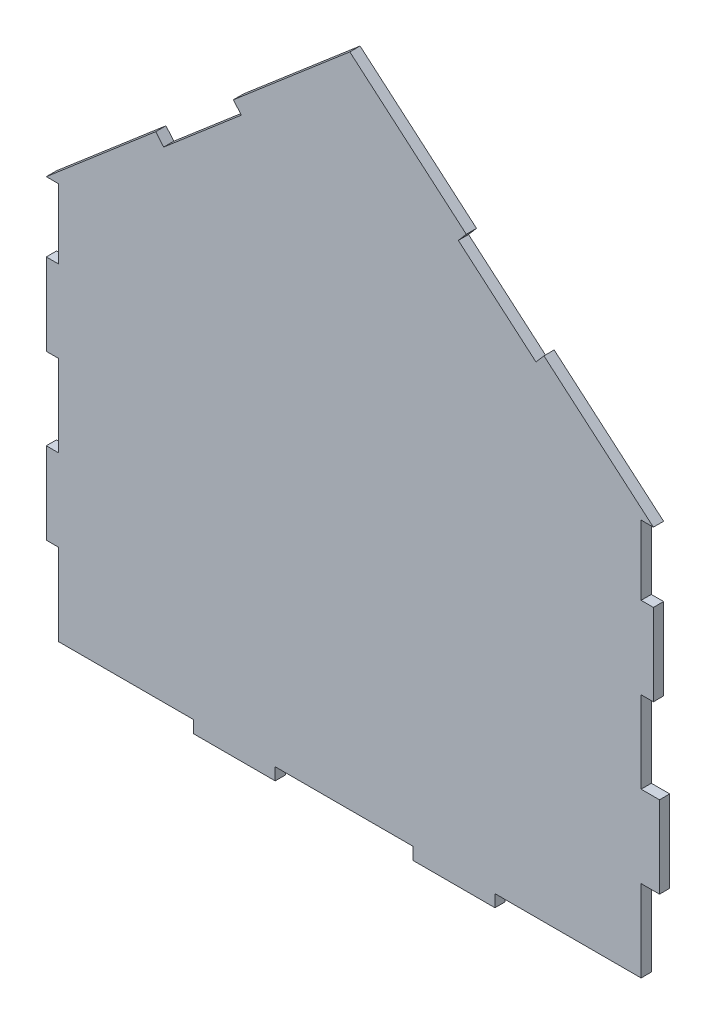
ISO-10303-21;
HEADER;
FILE_DESCRIPTION(('STEP AP214'),'2;1');
FILE_NAME('part.step','',(''),(''),'','','');
FILE_SCHEMA(('AUTOMOTIVE_DESIGN { 1 0 10303 214 1 1 1 1 }'));
ENDSEC;
DATA;
#1=APPLICATION_CONTEXT('core data for automotive mechanical design processes');
#2=APPLICATION_PROTOCOL_DEFINITION('international standard','automotive_design',2000,#1);
#3=PRODUCT_CONTEXT('',#1,'mechanical');
#4=PRODUCT('Part','Part','',(#3));
#5=PRODUCT_RELATED_PRODUCT_CATEGORY('part','',(#4));
#6=PRODUCT_DEFINITION_FORMATION('','',#4);
#7=PRODUCT_DEFINITION_CONTEXT('part definition',#1,'design');
#8=PRODUCT_DEFINITION('design','',#6,#7);
#9=PRODUCT_DEFINITION_SHAPE('','',#8);
#10=(LENGTH_UNIT() NAMED_UNIT(*) SI_UNIT(.MILLI.,.METRE.));
#11=(NAMED_UNIT(*) PLANE_ANGLE_UNIT() SI_UNIT($,.RADIAN.));
#12=(NAMED_UNIT(*) SI_UNIT($,.STERADIAN.) SOLID_ANGLE_UNIT());
#13=UNCERTAINTY_MEASURE_WITH_UNIT(LENGTH_MEASURE(1.E-05),#10,'distance_accuracy_value','');
#14=(GEOMETRIC_REPRESENTATION_CONTEXT(3) GLOBAL_UNCERTAINTY_ASSIGNED_CONTEXT((#13)) GLOBAL_UNIT_ASSIGNED_CONTEXT((#10,
#11,#12)) REPRESENTATION_CONTEXT('',''));
#15=CARTESIAN_POINT('',(0.,0.,0.));
#16=DIRECTION('',(0.,0.,1.));
#17=DIRECTION('',(1.,0.,0.));
#18=AXIS2_PLACEMENT_3D('',#15,#16,#17);
#19=CARTESIAN_POINT('',(-297.,-114.,10.));
#20=DIRECTION('',(0.,1.,0.));
#21=DIRECTION('',(0.,0.,1.));
#22=AXIS2_PLACEMENT_3D('',#19,#20,#21);
#23=PLANE('',#22);
#24=DIRECTION('',(1.,0.,0.));
#25=VECTOR('',#24,1.);
#26=CARTESIAN_POINT('',(-297.,-114.,0.));
#27=LINE('',#26,#25);
#28=CARTESIAN_POINT('',(-297.,-114.,0.));
#29=VERTEX_POINT('',#28);
#30=CARTESIAN_POINT('',(-285.,-114.,0.));
#31=VERTEX_POINT('',#30);
#32=EDGE_CURVE('E321',#29,#31,#27,.T.);
#33=ORIENTED_EDGE('',*,*,#32,.T.);
#34=DIRECTION('',(0.,0.,-1.));
#35=VECTOR('',#34,1.);
#36=CARTESIAN_POINT('',(-285.,-114.,10.));
#37=LINE('',#36,#35);
#38=CARTESIAN_POINT('',(-285.,-114.,10.));
#39=VERTEX_POINT('',#38);
#40=EDGE_CURVE('E11',#39,#31,#37,.T.);
#41=ORIENTED_EDGE('',*,*,#40,.F.);
#42=DIRECTION('',(1.,0.,0.));
#43=VECTOR('',#42,1.);
#44=CARTESIAN_POINT('',(-297.,-114.,10.));
#45=LINE('',#44,#43);
#46=CARTESIAN_POINT('',(-297.,-114.,10.));
#47=VERTEX_POINT('',#46);
#48=EDGE_CURVE('E400',#47,#39,#45,.T.);
#49=ORIENTED_EDGE('',*,*,#48,.F.);
#50=DIRECTION('',(0.,0.,-1.));
#51=VECTOR('',#50,1.);
#52=CARTESIAN_POINT('',(-297.,-114.,10.));
#53=LINE('',#52,#51);
#54=EDGE_CURVE('E320',#47,#29,#53,.T.);
#55=ORIENTED_EDGE('',*,*,#54,.T.);
#56=EDGE_LOOP('',(#33,#41,#49,#55));
#57=FACE_BOUND('',#56,.T.);
#58=ADVANCED_FACE('F39',(#57),#23,.F.);
#59=CARTESIAN_POINT('',(-285.,-114.,10.));
#60=DIRECTION('',(1.,0.,0.));
#61=DIRECTION('',(0.,0.,-1.));
#62=AXIS2_PLACEMENT_3D('',#59,#60,#61);
#63=PLANE('',#62);
#64=DIRECTION('',(0.,-1.,0.));
#65=VECTOR('',#64,1.);
#66=CARTESIAN_POINT('',(-285.,-114.,0.));
#67=LINE('',#66,#65);
#68=CARTESIAN_POINT('',(-285.,-194.,0.));
#69=VERTEX_POINT('',#68);
#70=EDGE_CURVE('E322',#31,#69,#67,.T.);
#71=ORIENTED_EDGE('',*,*,#70,.T.);
#72=DIRECTION('',(0.,0.,-1.));
#73=VECTOR('',#72,1.);
#74=CARTESIAN_POINT('',(-285.,-194.,10.));
#75=LINE('',#74,#73);
#76=CARTESIAN_POINT('',(-285.,-194.,10.));
#77=VERTEX_POINT('',#76);
#78=EDGE_CURVE('E50',#77,#69,#75,.T.);
#79=ORIENTED_EDGE('',*,*,#78,.F.);
#80=DIRECTION('',(0.,-1.,0.));
#81=VECTOR('',#80,1.);
#82=CARTESIAN_POINT('',(-285.,-114.,10.));
#83=LINE('',#82,#81);
#84=EDGE_CURVE('E193',#39,#77,#83,.T.);
#85=ORIENTED_EDGE('',*,*,#84,.F.);
#86=ORIENTED_EDGE('',*,*,#40,.T.);
#87=EDGE_LOOP('',(#71,#79,#85,#86));
#88=FACE_BOUND('',#87,.T.);
#89=ADVANCED_FACE('F608',(#88),#63,.F.);
#90=CARTESIAN_POINT('',(-153.,-194.,10.));
#91=DIRECTION('',(0.,1.,0.));
#92=DIRECTION('',(0.,0.,1.));
#93=AXIS2_PLACEMENT_3D('',#90,#91,#92);
#94=PLANE('',#93);
#95=DIRECTION('',(1.,0.,0.));
#96=VECTOR('',#95,1.);
#97=CARTESIAN_POINT('',(-153.,-194.,0.));
#98=LINE('',#97,#96);
#99=CARTESIAN_POINT('',(-153.,-194.,0.));
#100=VERTEX_POINT('',#99);
#101=EDGE_CURVE('E326',#69,#100,#98,.T.);
#102=ORIENTED_EDGE('',*,*,#101,.T.);
#103=DIRECTION('',(0.,0.,-1.));
#104=VECTOR('',#103,1.);
#105=CARTESIAN_POINT('',(-153.,-194.,10.));
#106=LINE('',#105,#104);
#107=CARTESIAN_POINT('',(-153.,-194.,10.));
#108=VERTEX_POINT('',#107);
#109=EDGE_CURVE('E500',#108,#100,#106,.T.);
#110=ORIENTED_EDGE('',*,*,#109,.F.);
#111=DIRECTION('',(1.,0.,0.));
#112=VECTOR('',#111,1.);
#113=CARTESIAN_POINT('',(-153.,-194.,10.));
#114=LINE('',#113,#112);
#115=EDGE_CURVE('E502',#77,#108,#114,.T.);
#116=ORIENTED_EDGE('',*,*,#115,.F.);
#117=ORIENTED_EDGE('',*,*,#78,.T.);
#118=EDGE_LOOP('',(#102,#110,#116,#117));
#119=FACE_BOUND('',#118,.T.);
#120=ADVANCED_FACE('F505',(#119),#94,.F.);
#121=CARTESIAN_POINT('',(-153.,-194.,10.));
#122=DIRECTION('',(1.,0.,0.));
#123=DIRECTION('',(0.,0.,-1.));
#124=AXIS2_PLACEMENT_3D('',#121,#122,#123);
#125=PLANE('',#124);
#126=DIRECTION('',(0.,-1.,0.));
#127=VECTOR('',#126,1.);
#128=CARTESIAN_POINT('',(-153.,-194.,0.));
#129=LINE('',#128,#127);
#130=CARTESIAN_POINT('',(-153.,-206.,0.));
#131=VERTEX_POINT('',#130);
#132=EDGE_CURVE('E327',#100,#131,#129,.T.);
#133=ORIENTED_EDGE('',*,*,#132,.T.);
#134=DIRECTION('',(0.,0.,-1.));
#135=VECTOR('',#134,1.);
#136=CARTESIAN_POINT('',(-153.,-206.,10.));
#137=LINE('',#136,#135);
#138=CARTESIAN_POINT('',(-153.,-206.,10.));
#139=VERTEX_POINT('',#138);
#140=EDGE_CURVE('E493',#139,#131,#137,.T.);
#141=ORIENTED_EDGE('',*,*,#140,.F.);
#142=DIRECTION('',(0.,-1.,0.));
#143=VECTOR('',#142,1.);
#144=CARTESIAN_POINT('',(-153.,-194.,10.));
#145=LINE('',#144,#143);
#146=EDGE_CURVE('E521',#108,#139,#145,.T.);
#147=ORIENTED_EDGE('',*,*,#146,.F.);
#148=ORIENTED_EDGE('',*,*,#109,.T.);
#149=EDGE_LOOP('',(#133,#141,#147,#148));
#150=FACE_BOUND('',#149,.T.);
#151=ADVANCED_FACE('F514',(#150),#125,.F.);
#152=CARTESIAN_POINT('',(-153.,-206.,10.));
#153=DIRECTION('',(0.,1.,0.));
#154=DIRECTION('',(0.,0.,1.));
#155=AXIS2_PLACEMENT_3D('',#152,#153,#154);
#156=PLANE('',#155);
#157=DIRECTION('',(1.,0.,0.));
#158=VECTOR('',#157,1.);
#159=CARTESIAN_POINT('',(-153.,-206.,0.));
#160=LINE('',#159,#158);
#161=CARTESIAN_POINT('',(-72.9999999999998,-206.,0.));
#162=VERTEX_POINT('',#161);
#163=EDGE_CURVE('E329',#131,#162,#160,.T.);
#164=ORIENTED_EDGE('',*,*,#163,.T.);
#165=DIRECTION('',(0.,0.,-1.));
#166=VECTOR('',#165,1.);
#167=CARTESIAN_POINT('',(-72.9999999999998,-206.,10.));
#168=LINE('',#167,#166);
#169=CARTESIAN_POINT('',(-72.9999999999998,-206.,10.));
#170=VERTEX_POINT('',#169);
#171=EDGE_CURVE('E491',#170,#162,#168,.T.);
#172=ORIENTED_EDGE('',*,*,#171,.F.);
#173=DIRECTION('',(1.,0.,0.));
#174=VECTOR('',#173,1.);
#175=CARTESIAN_POINT('',(-153.,-206.,10.));
#176=LINE('',#175,#174);
#177=EDGE_CURVE('E517',#139,#170,#176,.T.);
#178=ORIENTED_EDGE('',*,*,#177,.F.);
#179=ORIENTED_EDGE('',*,*,#140,.T.);
#180=EDGE_LOOP('',(#164,#172,#178,#179));
#181=FACE_BOUND('',#180,.T.);
#182=ADVANCED_FACE('F520',(#181),#156,.F.);
#183=CARTESIAN_POINT('',(-72.9999999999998,-194.,10.));
#184=DIRECTION('',(-1.,0.,0.));
#185=DIRECTION('',(0.,-1.,0.));
#186=AXIS2_PLACEMENT_3D('',#183,#184,#185);
#187=PLANE('',#186);
#188=DIRECTION('',(0.,1.,0.));
#189=VECTOR('',#188,1.);
#190=CARTESIAN_POINT('',(-72.9999999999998,-194.,0.));
#191=LINE('',#190,#189);
#192=CARTESIAN_POINT('',(-72.9999999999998,-194.,0.));
#193=VERTEX_POINT('',#192);
#194=EDGE_CURVE('E335',#162,#193,#191,.T.);
#195=ORIENTED_EDGE('',*,*,#194,.T.);
#196=DIRECTION('',(0.,0.,-1.));
#197=VECTOR('',#196,1.);
#198=CARTESIAN_POINT('',(-72.9999999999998,-194.,10.));
#199=LINE('',#198,#197);
#200=CARTESIAN_POINT('',(-72.9999999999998,-194.,10.));
#201=VERTEX_POINT('',#200);
#202=EDGE_CURVE('E488',#201,#193,#199,.T.);
#203=ORIENTED_EDGE('',*,*,#202,.F.);
#204=DIRECTION('',(0.,1.,0.));
#205=VECTOR('',#204,1.);
#206=CARTESIAN_POINT('',(-72.9999999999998,-194.,10.));
#207=LINE('',#206,#205);
#208=EDGE_CURVE('E525',#170,#201,#207,.T.);
#209=ORIENTED_EDGE('',*,*,#208,.F.);
#210=ORIENTED_EDGE('',*,*,#171,.T.);
#211=EDGE_LOOP('',(#195,#203,#209,#210));
#212=FACE_BOUND('',#211,.T.);
#213=ADVANCED_FACE('F621',(#212),#187,.F.);
#214=CARTESIAN_POINT('',(62.0000000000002,-194.,10.));
#215=DIRECTION('',(0.,1.,0.));
#216=DIRECTION('',(0.,0.,1.));
#217=AXIS2_PLACEMENT_3D('',#214,#215,#216);
#218=PLANE('',#217);
#219=DIRECTION('',(1.,0.,0.));
#220=VECTOR('',#219,1.);
#221=CARTESIAN_POINT('',(62.0000000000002,-194.,0.));
#222=LINE('',#221,#220);
#223=CARTESIAN_POINT('',(62.0000000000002,-194.,0.));
#224=VERTEX_POINT('',#223);
#225=EDGE_CURVE('E331',#193,#224,#222,.T.);
#226=ORIENTED_EDGE('',*,*,#225,.T.);
#227=DIRECTION('',(0.,0.,-1.));
#228=VECTOR('',#227,1.);
#229=CARTESIAN_POINT('',(62.0000000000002,-194.,10.));
#230=LINE('',#229,#228);
#231=CARTESIAN_POINT('',(62.0000000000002,-194.,10.));
#232=VERTEX_POINT('',#231);
#233=EDGE_CURVE('E484',#232,#224,#230,.T.);
#234=ORIENTED_EDGE('',*,*,#233,.F.);
#235=DIRECTION('',(1.,0.,0.));
#236=VECTOR('',#235,1.);
#237=CARTESIAN_POINT('',(62.0000000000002,-194.,10.));
#238=LINE('',#237,#236);
#239=EDGE_CURVE('E524',#201,#232,#238,.T.);
#240=ORIENTED_EDGE('',*,*,#239,.F.);
#241=ORIENTED_EDGE('',*,*,#202,.T.);
#242=EDGE_LOOP('',(#226,#234,#240,#241));
#243=FACE_BOUND('',#242,.T.);
#244=ADVANCED_FACE('F629',(#243),#218,.F.);
#245=CARTESIAN_POINT('',(62.0000000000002,-194.,10.));
#246=DIRECTION('',(1.,0.,0.));
#247=DIRECTION('',(0.,0.,-1.));
#248=AXIS2_PLACEMENT_3D('',#245,#246,#247);
#249=PLANE('',#248);
#250=DIRECTION('',(0.,-1.,0.));
#251=VECTOR('',#250,1.);
#252=CARTESIAN_POINT('',(62.0000000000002,-194.,0.));
#253=LINE('',#252,#251);
#254=CARTESIAN_POINT('',(62.0000000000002,-206.,0.));
#255=VERTEX_POINT('',#254);
#256=EDGE_CURVE('E339',#224,#255,#253,.T.);
#257=ORIENTED_EDGE('',*,*,#256,.T.);
#258=DIRECTION('',(0.,0.,-1.));
#259=VECTOR('',#258,1.);
#260=CARTESIAN_POINT('',(62.0000000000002,-206.,10.));
#261=LINE('',#260,#259);
#262=CARTESIAN_POINT('',(62.0000000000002,-206.,10.));
#263=VERTEX_POINT('',#262);
#264=EDGE_CURVE('E485',#263,#255,#261,.T.);
#265=ORIENTED_EDGE('',*,*,#264,.F.);
#266=DIRECTION('',(0.,-1.,0.));
#267=VECTOR('',#266,1.);
#268=CARTESIAN_POINT('',(62.0000000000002,-194.,10.));
#269=LINE('',#268,#267);
#270=EDGE_CURVE('E533',#232,#263,#269,.T.);
#271=ORIENTED_EDGE('',*,*,#270,.F.);
#272=ORIENTED_EDGE('',*,*,#233,.T.);
#273=EDGE_LOOP('',(#257,#265,#271,#272));
#274=FACE_BOUND('',#273,.T.);
#275=ADVANCED_FACE('F627',(#274),#249,.F.);
#276=CARTESIAN_POINT('',(62.0000000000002,-206.,10.));
#277=DIRECTION('',(0.,1.,0.));
#278=DIRECTION('',(0.,0.,1.));
#279=AXIS2_PLACEMENT_3D('',#276,#277,#278);
#280=PLANE('',#279);
#281=DIRECTION('',(1.,0.,0.));
#282=VECTOR('',#281,1.);
#283=CARTESIAN_POINT('',(62.0000000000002,-206.,0.));
#284=LINE('',#283,#282);
#285=CARTESIAN_POINT('',(142.,-206.,0.));
#286=VERTEX_POINT('',#285);
#287=EDGE_CURVE('E340',#255,#286,#284,.T.);
#288=ORIENTED_EDGE('',*,*,#287,.T.);
#289=DIRECTION('',(0.,0.,-1.));
#290=VECTOR('',#289,1.);
#291=CARTESIAN_POINT('',(142.,-206.,10.));
#292=LINE('',#291,#290);
#293=CARTESIAN_POINT('',(142.,-206.,10.));
#294=VERTEX_POINT('',#293);
#295=EDGE_CURVE('E479',#294,#286,#292,.T.);
#296=ORIENTED_EDGE('',*,*,#295,.F.);
#297=DIRECTION('',(1.,0.,0.));
#298=VECTOR('',#297,1.);
#299=CARTESIAN_POINT('',(62.0000000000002,-206.,10.));
#300=LINE('',#299,#298);
#301=EDGE_CURVE('E531',#263,#294,#300,.T.);
#302=ORIENTED_EDGE('',*,*,#301,.F.);
#303=ORIENTED_EDGE('',*,*,#264,.T.);
#304=EDGE_LOOP('',(#288,#296,#302,#303));
#305=FACE_BOUND('',#304,.T.);
#306=ADVANCED_FACE('F632',(#305),#280,.F.);
#307=CARTESIAN_POINT('',(142.,-194.,10.));
#308=DIRECTION('',(-1.,0.,0.));
#309=DIRECTION('',(0.,0.,1.));
#310=AXIS2_PLACEMENT_3D('',#307,#308,#309);
#311=PLANE('',#310);
#312=DIRECTION('',(0.,1.,0.));
#313=VECTOR('',#312,1.);
#314=CARTESIAN_POINT('',(142.,-194.,0.));
#315=LINE('',#314,#313);
#316=CARTESIAN_POINT('',(142.,-194.,0.));
#317=VERTEX_POINT('',#316);
#318=EDGE_CURVE('E337',#286,#317,#315,.T.);
#319=ORIENTED_EDGE('',*,*,#318,.T.);
#320=DIRECTION('',(0.,0.,-1.));
#321=VECTOR('',#320,1.);
#322=CARTESIAN_POINT('',(142.,-194.,10.));
#323=LINE('',#322,#321);
#324=CARTESIAN_POINT('',(142.,-194.,10.));
#325=VERTEX_POINT('',#324);
#326=EDGE_CURVE('E478',#325,#317,#323,.T.);
#327=ORIENTED_EDGE('',*,*,#326,.F.);
#328=DIRECTION('',(0.,1.,0.));
#329=VECTOR('',#328,1.);
#330=CARTESIAN_POINT('',(142.,-194.,10.));
#331=LINE('',#330,#329);
#332=EDGE_CURVE('E532',#294,#325,#331,.T.);
#333=ORIENTED_EDGE('',*,*,#332,.F.);
#334=ORIENTED_EDGE('',*,*,#295,.T.);
#335=EDGE_LOOP('',(#319,#327,#333,#334));
#336=FACE_BOUND('',#335,.T.);
#337=ADVANCED_FACE('F636',(#336),#311,.F.);
#338=CARTESIAN_POINT('',(285.,-194.,10.));
#339=DIRECTION('',(0.,1.,0.));
#340=DIRECTION('',(0.,0.,1.));
#341=AXIS2_PLACEMENT_3D('',#338,#339,#340);
#342=PLANE('',#341);
#343=DIRECTION('',(1.,0.,0.));
#344=VECTOR('',#343,1.);
#345=CARTESIAN_POINT('',(285.,-194.,0.));
#346=LINE('',#345,#344);
#347=CARTESIAN_POINT('',(285.,-194.,0.));
#348=VERTEX_POINT('',#347);
#349=EDGE_CURVE('E345',#317,#348,#346,.T.);
#350=ORIENTED_EDGE('',*,*,#349,.T.);
#351=DIRECTION('',(0.,0.,-1.));
#352=VECTOR('',#351,1.);
#353=CARTESIAN_POINT('',(285.,-194.,10.));
#354=LINE('',#353,#352);
#355=CARTESIAN_POINT('',(285.,-194.,10.));
#356=VERTEX_POINT('',#355);
#357=EDGE_CURVE('E471',#356,#348,#354,.T.);
#358=ORIENTED_EDGE('',*,*,#357,.F.);
#359=DIRECTION('',(1.,0.,0.));
#360=VECTOR('',#359,1.);
#361=CARTESIAN_POINT('',(285.,-194.,10.));
#362=LINE('',#361,#360);
#363=EDGE_CURVE('E540',#325,#356,#362,.T.);
#364=ORIENTED_EDGE('',*,*,#363,.F.);
#365=ORIENTED_EDGE('',*,*,#326,.T.);
#366=EDGE_LOOP('',(#350,#358,#364,#365));
#367=FACE_BOUND('',#366,.T.);
#368=ADVANCED_FACE('F645',(#367),#342,.F.);
#369=CARTESIAN_POINT('',(285.,-114.,10.));
#370=DIRECTION('',(-1.,0.,0.));
#371=DIRECTION('',(0.,0.,1.));
#372=AXIS2_PLACEMENT_3D('',#369,#370,#371);
#373=PLANE('',#372);
#374=DIRECTION('',(0.,1.,0.));
#375=VECTOR('',#374,1.);
#376=CARTESIAN_POINT('',(285.,-114.,0.));
#377=LINE('',#376,#375);
#378=CARTESIAN_POINT('',(285.,-114.,0.));
#379=VERTEX_POINT('',#378);
#380=EDGE_CURVE('E342',#348,#379,#377,.T.);
#381=ORIENTED_EDGE('',*,*,#380,.T.);
#382=DIRECTION('',(0.,0.,-1.));
#383=VECTOR('',#382,1.);
#384=CARTESIAN_POINT('',(285.,-114.,10.));
#385=LINE('',#384,#383);
#386=CARTESIAN_POINT('',(285.,-114.,10.));
#387=VERTEX_POINT('',#386);
#388=EDGE_CURVE('E469',#387,#379,#385,.T.);
#389=ORIENTED_EDGE('',*,*,#388,.F.);
#390=DIRECTION('',(0.,1.,0.));
#391=VECTOR('',#390,1.);
#392=CARTESIAN_POINT('',(285.,-114.,10.));
#393=LINE('',#392,#391);
#394=EDGE_CURVE('E537',#356,#387,#393,.T.);
#395=ORIENTED_EDGE('',*,*,#394,.F.);
#396=ORIENTED_EDGE('',*,*,#357,.T.);
#397=EDGE_LOOP('',(#381,#389,#395,#396));
#398=FACE_BOUND('',#397,.T.);
#399=ADVANCED_FACE('F646',(#398),#373,.F.);
#400=CARTESIAN_POINT('',(303.,-114.,10.));
#401=DIRECTION('',(0.,1.,0.));
#402=DIRECTION('',(-1.,0.,0.));
#403=AXIS2_PLACEMENT_3D('',#400,#401,#402);
#404=PLANE('',#403);
#405=DIRECTION('',(1.,0.,0.));
#406=VECTOR('',#405,1.);
#407=CARTESIAN_POINT('',(303.,-114.,0.));
#408=LINE('',#407,#406);
#409=CARTESIAN_POINT('',(303.,-114.,0.));
#410=VERTEX_POINT('',#409);
#411=EDGE_CURVE('E347',#379,#410,#408,.T.);
#412=ORIENTED_EDGE('',*,*,#411,.T.);
#413=DIRECTION('',(0.,0.,-1.));
#414=VECTOR('',#413,1.);
#415=CARTESIAN_POINT('',(303.,-114.,10.));
#416=LINE('',#415,#414);
#417=CARTESIAN_POINT('',(303.,-114.,10.));
#418=VERTEX_POINT('',#417);
#419=EDGE_CURVE('E470',#418,#410,#416,.T.);
#420=ORIENTED_EDGE('',*,*,#419,.F.);
#421=DIRECTION('',(1.,0.,0.));
#422=VECTOR('',#421,1.);
#423=CARTESIAN_POINT('',(303.,-114.,10.));
#424=LINE('',#423,#422);
#425=EDGE_CURVE('E541',#387,#418,#424,.T.);
#426=ORIENTED_EDGE('',*,*,#425,.F.);
#427=ORIENTED_EDGE('',*,*,#388,.T.);
#428=EDGE_LOOP('',(#412,#420,#426,#427));
#429=FACE_BOUND('',#428,.T.);
#430=ADVANCED_FACE('F649',(#429),#404,.F.);
#431=CARTESIAN_POINT('',(303.,-34.,10.));
#432=DIRECTION('',(-1.,0.,0.));
#433=DIRECTION('',(0.,0.,1.));
#434=AXIS2_PLACEMENT_3D('',#431,#432,#433);
#435=PLANE('',#434);
#436=DIRECTION('',(0.,1.,0.));
#437=VECTOR('',#436,1.);
#438=CARTESIAN_POINT('',(303.,-34.,0.));
#439=LINE('',#438,#437);
#440=CARTESIAN_POINT('',(303.,-34.,0.));
#441=VERTEX_POINT('',#440);
#442=EDGE_CURVE('E346',#410,#441,#439,.T.);
#443=ORIENTED_EDGE('',*,*,#442,.T.);
#444=DIRECTION('',(0.,0.,-1.));
#445=VECTOR('',#444,1.);
#446=CARTESIAN_POINT('',(303.,-34.,10.));
#447=LINE('',#446,#445);
#448=CARTESIAN_POINT('',(303.,-34.,10.));
#449=VERTEX_POINT('',#448);
#450=EDGE_CURVE('E463',#449,#441,#447,.T.);
#451=ORIENTED_EDGE('',*,*,#450,.F.);
#452=DIRECTION('',(0.,1.,0.));
#453=VECTOR('',#452,1.);
#454=CARTESIAN_POINT('',(303.,-34.,10.));
#455=LINE('',#454,#453);
#456=EDGE_CURVE('E543',#418,#449,#455,.T.);
#457=ORIENTED_EDGE('',*,*,#456,.F.);
#458=ORIENTED_EDGE('',*,*,#419,.T.);
#459=EDGE_LOOP('',(#443,#451,#457,#458));
#460=FACE_BOUND('',#459,.T.);
#461=ADVANCED_FACE('F652',(#460),#435,.F.);
#462=CARTESIAN_POINT('',(303.,-34.,10.));
#463=DIRECTION('',(0.,-1.,0.));
#464=DIRECTION('',(1.,0.,0.));
#465=AXIS2_PLACEMENT_3D('',#462,#463,#464);
#466=PLANE('',#465);
#467=DIRECTION('',(-1.,0.,0.));
#468=VECTOR('',#467,1.);
#469=CARTESIAN_POINT('',(303.,-34.,0.));
#470=LINE('',#469,#468);
#471=CARTESIAN_POINT('',(285.,-34.,0.));
#472=VERTEX_POINT('',#471);
#473=EDGE_CURVE('E348',#441,#472,#470,.T.);
#474=ORIENTED_EDGE('',*,*,#473,.T.);
#475=DIRECTION('',(0.,0.,-1.));
#476=VECTOR('',#475,1.);
#477=CARTESIAN_POINT('',(285.,-34.,10.));
#478=LINE('',#477,#476);
#479=CARTESIAN_POINT('',(285.,-34.,10.));
#480=VERTEX_POINT('',#479);
#481=EDGE_CURVE('E464',#480,#472,#478,.T.);
#482=ORIENTED_EDGE('',*,*,#481,.F.);
#483=DIRECTION('',(-1.,0.,0.));
#484=VECTOR('',#483,1.);
#485=CARTESIAN_POINT('',(303.,-34.,10.));
#486=LINE('',#485,#484);
#487=EDGE_CURVE('E544',#449,#480,#486,.T.);
#488=ORIENTED_EDGE('',*,*,#487,.F.);
#489=ORIENTED_EDGE('',*,*,#450,.T.);
#490=EDGE_LOOP('',(#474,#482,#488,#489));
#491=FACE_BOUND('',#490,.T.);
#492=ADVANCED_FACE('F657',(#491),#466,.F.);
#493=CARTESIAN_POINT('',(285.,-34.,10.));
#494=DIRECTION('',(-1.,0.,0.));
#495=DIRECTION('',(0.,0.,1.));
#496=AXIS2_PLACEMENT_3D('',#493,#494,#495);
#497=PLANE('',#496);
#498=DIRECTION('',(0.,1.,0.));
#499=VECTOR('',#498,1.);
#500=CARTESIAN_POINT('',(285.,-34.,0.));
#501=LINE('',#500,#499);
#502=CARTESIAN_POINT('',(285.,46.,0.));
#503=VERTEX_POINT('',#502);
#504=EDGE_CURVE('E351',#472,#503,#501,.T.);
#505=ORIENTED_EDGE('',*,*,#504,.T.);
#506=DIRECTION('',(0.,0.,-1.));
#507=VECTOR('',#506,1.);
#508=CARTESIAN_POINT('',(285.,46.,10.));
#509=LINE('',#508,#507);
#510=CARTESIAN_POINT('',(285.,46.,10.));
#511=VERTEX_POINT('',#510);
#512=EDGE_CURVE('E456',#511,#503,#509,.T.);
#513=ORIENTED_EDGE('',*,*,#512,.F.);
#514=DIRECTION('',(0.,1.,0.));
#515=VECTOR('',#514,1.);
#516=CARTESIAN_POINT('',(285.,-34.,10.));
#517=LINE('',#516,#515);
#518=EDGE_CURVE('E550',#480,#511,#517,.T.);
#519=ORIENTED_EDGE('',*,*,#518,.F.);
#520=ORIENTED_EDGE('',*,*,#481,.T.);
#521=EDGE_LOOP('',(#505,#513,#519,#520));
#522=FACE_BOUND('',#521,.T.);
#523=ADVANCED_FACE('F665',(#522),#497,.F.);
#524=CARTESIAN_POINT('',(297.,46.,10.));
#525=DIRECTION('',(0.,1.,0.));
#526=DIRECTION('',(0.,0.,1.));
#527=AXIS2_PLACEMENT_3D('',#524,#525,#526);
#528=PLANE('',#527);
#529=DIRECTION('',(1.,0.,0.));
#530=VECTOR('',#529,1.);
#531=CARTESIAN_POINT('',(297.,46.,0.));
#532=LINE('',#531,#530);
#533=CARTESIAN_POINT('',(297.,46.,0.));
#534=VERTEX_POINT('',#533);
#535=EDGE_CURVE('E353',#503,#534,#532,.T.);
#536=ORIENTED_EDGE('',*,*,#535,.T.);
#537=DIRECTION('',(0.,0.,-1.));
#538=VECTOR('',#537,1.);
#539=CARTESIAN_POINT('',(297.,46.,10.));
#540=LINE('',#539,#538);
#541=CARTESIAN_POINT('',(297.,46.,10.));
#542=VERTEX_POINT('',#541);
#543=EDGE_CURVE('E454',#542,#534,#540,.T.);
#544=ORIENTED_EDGE('',*,*,#543,.F.);
#545=DIRECTION('',(1.,0.,0.));
#546=VECTOR('',#545,1.);
#547=CARTESIAN_POINT('',(297.,46.,10.));
#548=LINE('',#547,#546);
#549=EDGE_CURVE('E548',#511,#542,#548,.T.);
#550=ORIENTED_EDGE('',*,*,#549,.F.);
#551=ORIENTED_EDGE('',*,*,#512,.T.);
#552=EDGE_LOOP('',(#536,#544,#550,#551));
#553=FACE_BOUND('',#552,.T.);
#554=ADVANCED_FACE('F669',(#553),#528,.F.);
#555=CARTESIAN_POINT('',(297.,46.,10.));
#556=DIRECTION('',(-1.,0.,0.));
#557=DIRECTION('',(0.,0.,1.));
#558=AXIS2_PLACEMENT_3D('',#555,#556,#557);
#559=PLANE('',#558);
#560=DIRECTION('',(0.,1.,0.));
#561=VECTOR('',#560,1.);
#562=CARTESIAN_POINT('',(297.,46.,0.));
#563=LINE('',#562,#561);
#564=CARTESIAN_POINT('',(297.,126.,0.));
#565=VERTEX_POINT('',#564);
#566=EDGE_CURVE('E358',#534,#565,#563,.T.);
#567=ORIENTED_EDGE('',*,*,#566,.T.);
#568=DIRECTION('',(0.,0.,-1.));
#569=VECTOR('',#568,1.);
#570=CARTESIAN_POINT('',(297.,126.,10.));
#571=LINE('',#570,#569);
#572=CARTESIAN_POINT('',(297.,126.,10.));
#573=VERTEX_POINT('',#572);
#574=EDGE_CURVE('E455',#573,#565,#571,.T.);
#575=ORIENTED_EDGE('',*,*,#574,.F.);
#576=DIRECTION('',(0.,1.,0.));
#577=VECTOR('',#576,1.);
#578=CARTESIAN_POINT('',(297.,46.,10.));
#579=LINE('',#578,#577);
#580=EDGE_CURVE('E552',#542,#573,#579,.T.);
#581=ORIENTED_EDGE('',*,*,#580,.F.);
#582=ORIENTED_EDGE('',*,*,#543,.T.);
#583=EDGE_LOOP('',(#567,#575,#581,#582));
#584=FACE_BOUND('',#583,.T.);
#585=ADVANCED_FACE('F667',(#584),#559,.F.);
#586=CARTESIAN_POINT('',(297.,126.,10.));
#587=DIRECTION('',(0.,-1.,0.));
#588=DIRECTION('',(0.,0.,-1.));
#589=AXIS2_PLACEMENT_3D('',#586,#587,#588);
#590=PLANE('',#589);
#591=DIRECTION('',(-1.,0.,0.));
#592=VECTOR('',#591,1.);
#593=CARTESIAN_POINT('',(297.,126.,0.));
#594=LINE('',#593,#592);
#595=CARTESIAN_POINT('',(285.,126.,0.));
#596=VERTEX_POINT('',#595);
#597=EDGE_CURVE('E356',#565,#596,#594,.T.);
#598=ORIENTED_EDGE('',*,*,#597,.T.);
#599=DIRECTION('',(0.,0.,-1.));
#600=VECTOR('',#599,1.);
#601=CARTESIAN_POINT('',(285.,126.,10.));
#602=LINE('',#601,#600);
#603=CARTESIAN_POINT('',(285.,126.,10.));
#604=VERTEX_POINT('',#603);
#605=EDGE_CURVE('E448',#604,#596,#602,.T.);
#606=ORIENTED_EDGE('',*,*,#605,.F.);
#607=DIRECTION('',(-1.,0.,0.));
#608=VECTOR('',#607,1.);
#609=CARTESIAN_POINT('',(297.,126.,10.));
#610=LINE('',#609,#608);
#611=EDGE_CURVE('E554',#573,#604,#610,.T.);
#612=ORIENTED_EDGE('',*,*,#611,.F.);
#613=ORIENTED_EDGE('',*,*,#574,.T.);
#614=EDGE_LOOP('',(#598,#606,#612,#613));
#615=FACE_BOUND('',#614,.T.);
#616=ADVANCED_FACE('F672',(#615),#590,.F.);
#617=CARTESIAN_POINT('',(285.,194.,10.));
#618=DIRECTION('',(-1.,0.,0.));
#619=DIRECTION('',(0.,0.,1.));
#620=AXIS2_PLACEMENT_3D('',#617,#618,#619);
#621=PLANE('',#620);
#622=DIRECTION('',(0.,1.,0.));
#623=VECTOR('',#622,1.);
#624=CARTESIAN_POINT('',(285.,194.,0.));
#625=LINE('',#624,#623);
#626=CARTESIAN_POINT('',(285.,194.,0.));
#627=VERTEX_POINT('',#626);
#628=EDGE_CURVE('E359',#596,#627,#625,.T.);
#629=ORIENTED_EDGE('',*,*,#628,.T.);
#630=DIRECTION('',(0.,0.,-1.));
#631=VECTOR('',#630,1.);
#632=CARTESIAN_POINT('',(285.,194.,10.));
#633=LINE('',#632,#631);
#634=CARTESIAN_POINT('',(285.,194.,10.));
#635=VERTEX_POINT('',#634);
#636=EDGE_CURVE('E449',#635,#627,#633,.T.);
#637=ORIENTED_EDGE('',*,*,#636,.F.);
#638=DIRECTION('',(0.,1.,0.));
#639=VECTOR('',#638,1.);
#640=CARTESIAN_POINT('',(285.,194.,10.));
#641=LINE('',#640,#639);
#642=EDGE_CURVE('E553',#604,#635,#641,.T.);
#643=ORIENTED_EDGE('',*,*,#642,.F.);
#644=ORIENTED_EDGE('',*,*,#605,.T.);
#645=EDGE_LOOP('',(#629,#637,#643,#644));
#646=FACE_BOUND('',#645,.T.);
#647=ADVANCED_FACE('F676',(#646),#621,.F.);
#648=CARTESIAN_POINT('',(297.,194.,10.));
#649=DIRECTION('',(0.,1.,0.));
#650=DIRECTION('',(0.,0.,1.));
#651=AXIS2_PLACEMENT_3D('',#648,#649,#650);
#652=PLANE('',#651);
#653=DIRECTION('',(1.,0.,0.));
#654=VECTOR('',#653,1.);
#655=CARTESIAN_POINT('',(297.,194.,0.));
#656=LINE('',#655,#654);
#657=CARTESIAN_POINT('',(297.,194.,0.));
#658=VERTEX_POINT('',#657);
#659=EDGE_CURVE('E362',#627,#658,#656,.T.);
#660=ORIENTED_EDGE('',*,*,#659,.T.);
#661=DIRECTION('',(0.,0.,-1.));
#662=VECTOR('',#661,1.);
#663=CARTESIAN_POINT('',(297.,194.,10.));
#664=LINE('',#663,#662);
#665=CARTESIAN_POINT('',(297.,194.,10.));
#666=VERTEX_POINT('',#665);
#667=EDGE_CURVE('E444',#666,#658,#664,.T.);
#668=ORIENTED_EDGE('',*,*,#667,.F.);
#669=DIRECTION('',(1.,0.,0.));
#670=VECTOR('',#669,1.);
#671=CARTESIAN_POINT('',(297.,194.,10.));
#672=LINE('',#671,#670);
#673=EDGE_CURVE('E556',#635,#666,#672,.T.);
#674=ORIENTED_EDGE('',*,*,#673,.F.);
#675=ORIENTED_EDGE('',*,*,#636,.T.);
#676=EDGE_LOOP('',(#660,#668,#674,#675));
#677=FACE_BOUND('',#676,.T.);
#678=ADVANCED_FACE('F681',(#677),#652,.F.);
#679=CARTESIAN_POINT('',(189.930360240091,285.641339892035,10.));
#680=DIRECTION('',(-0.650248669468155,-0.759721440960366,0.));
#681=DIRECTION('',(0.759721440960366,-0.650248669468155,0.));
#682=AXIS2_PLACEMENT_3D('',#679,#680,#681);
#683=PLANE('',#682);
#684=DIRECTION('',(-0.759721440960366,0.650248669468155,0.));
#685=VECTOR('',#684,1.);
#686=CARTESIAN_POINT('',(189.930360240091,285.641339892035,0.));
#687=LINE('',#686,#685);
#688=CARTESIAN_POINT('',(189.930360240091,285.641339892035,0.));
#689=VERTEX_POINT('',#688);
#690=EDGE_CURVE('E365',#658,#689,#687,.T.);
#691=ORIENTED_EDGE('',*,*,#690,.T.);
#692=DIRECTION('',(0.,0.,-1.));
#693=VECTOR('',#692,1.);
#694=CARTESIAN_POINT('',(189.930360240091,285.641339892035,10.));
#695=LINE('',#694,#693);
#696=CARTESIAN_POINT('',(189.930360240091,285.641339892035,10.));
#697=VERTEX_POINT('',#696);
#698=EDGE_CURVE('E439',#697,#689,#695,.T.);
#699=ORIENTED_EDGE('',*,*,#698,.F.);
#700=DIRECTION('',(-0.759721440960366,0.650248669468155,0.));
#701=VECTOR('',#700,1.);
#702=CARTESIAN_POINT('',(189.930360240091,285.641339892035,10.));
#703=LINE('',#702,#701);
#704=EDGE_CURVE('E558',#666,#697,#703,.T.);
#705=ORIENTED_EDGE('',*,*,#704,.F.);
#706=ORIENTED_EDGE('',*,*,#667,.T.);
#707=EDGE_LOOP('',(#691,#699,#705,#706));
#708=FACE_BOUND('',#707,.T.);
#709=ADVANCED_FACE('F688',(#708),#683,.F.);
#710=CARTESIAN_POINT('',(189.930360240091,285.641339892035,10.));
#711=DIRECTION('',(0.759721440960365,-0.650248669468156,0.));
#712=DIRECTION('',(0.650248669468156,0.759721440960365,0.));
#713=AXIS2_PLACEMENT_3D('',#710,#711,#712);
#714=PLANE('',#713);
#715=DIRECTION('',(-0.650248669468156,-0.759721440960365,0.));
#716=VECTOR('',#715,1.);
#717=CARTESIAN_POINT('',(189.930360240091,285.641339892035,0.));
#718=LINE('',#717,#716);
#719=CARTESIAN_POINT('',(182.127376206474,276.52468260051,0.));
#720=VERTEX_POINT('',#719);
#721=EDGE_CURVE('E368',#689,#720,#718,.T.);
#722=ORIENTED_EDGE('',*,*,#721,.T.);
#723=DIRECTION('',(0.,0.,-1.));
#724=VECTOR('',#723,1.);
#725=CARTESIAN_POINT('',(182.127376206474,276.52468260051,10.));
#726=LINE('',#725,#724);
#727=CARTESIAN_POINT('',(182.127376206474,276.52468260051,10.));
#728=VERTEX_POINT('',#727);
#729=EDGE_CURVE('E440',#728,#720,#726,.T.);
#730=ORIENTED_EDGE('',*,*,#729,.F.);
#731=DIRECTION('',(-0.650248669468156,-0.759721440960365,0.));
#732=VECTOR('',#731,1.);
#733=CARTESIAN_POINT('',(189.930360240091,285.641339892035,10.));
#734=LINE('',#733,#732);
#735=EDGE_CURVE('E563',#697,#728,#734,.T.);
#736=ORIENTED_EDGE('',*,*,#735,.F.);
#737=ORIENTED_EDGE('',*,*,#698,.T.);
#738=EDGE_LOOP('',(#722,#730,#736,#737));
#739=FACE_BOUND('',#738,.T.);
#740=ADVANCED_FACE('F689',(#739),#714,.F.);
#741=CARTESIAN_POINT('',(182.127376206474,276.52468260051,10.));
#742=DIRECTION('',(-0.650248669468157,-0.759721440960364,0.));
#743=DIRECTION('',(0.759721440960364,-0.650248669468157,0.));
#744=AXIS2_PLACEMENT_3D('',#741,#742,#743);
#745=PLANE('',#744);
#746=DIRECTION('',(-0.759721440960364,0.650248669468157,0.));
#747=VECTOR('',#746,1.);
#748=CARTESIAN_POINT('',(182.127376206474,276.52468260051,0.));
#749=LINE('',#748,#747);
#750=CARTESIAN_POINT('',(106.155232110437,341.549549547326,0.));
#751=VERTEX_POINT('',#750);
#752=EDGE_CURVE('E366',#720,#751,#749,.T.);
#753=ORIENTED_EDGE('',*,*,#752,.T.);
#754=DIRECTION('',(0.,0.,-1.));
#755=VECTOR('',#754,1.);
#756=CARTESIAN_POINT('',(106.155232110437,341.549549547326,10.));
#757=LINE('',#756,#755);
#758=CARTESIAN_POINT('',(106.155232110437,341.549549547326,10.));
#759=VERTEX_POINT('',#758);
#760=EDGE_CURVE('E432',#759,#751,#757,.T.);
#761=ORIENTED_EDGE('',*,*,#760,.F.);
#762=DIRECTION('',(-0.759721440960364,0.650248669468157,0.));
#763=VECTOR('',#762,1.);
#764=CARTESIAN_POINT('',(182.127376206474,276.52468260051,10.));
#765=LINE('',#764,#763);
#766=EDGE_CURVE('E561',#728,#759,#765,.T.);
#767=ORIENTED_EDGE('',*,*,#766,.F.);
#768=ORIENTED_EDGE('',*,*,#729,.T.);
#769=EDGE_LOOP('',(#753,#761,#767,#768));
#770=FACE_BOUND('',#769,.T.);
#771=ADVANCED_FACE('F695',(#770),#745,.F.);
#772=CARTESIAN_POINT('',(106.155232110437,341.549549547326,10.));
#773=DIRECTION('',(-0.759721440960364,0.650248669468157,0.));
#774=DIRECTION('',(-0.650248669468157,-0.759721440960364,0.));
#775=AXIS2_PLACEMENT_3D('',#772,#773,#774);
#776=PLANE('',#775);
#777=DIRECTION('',(0.650248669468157,0.759721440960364,0.));
#778=VECTOR('',#777,1.);
#779=CARTESIAN_POINT('',(106.155232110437,341.549549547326,0.));
#780=LINE('',#779,#778);
#781=CARTESIAN_POINT('',(113.958216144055,350.66620683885,0.));
#782=VERTEX_POINT('',#781);
#783=EDGE_CURVE('E367',#751,#782,#780,.T.);
#784=ORIENTED_EDGE('',*,*,#783,.T.);
#785=DIRECTION('',(0.,0.,-1.));
#786=VECTOR('',#785,1.);
#787=CARTESIAN_POINT('',(113.958216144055,350.66620683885,10.));
#788=LINE('',#787,#786);
#789=CARTESIAN_POINT('',(113.958216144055,350.66620683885,10.));
#790=VERTEX_POINT('',#789);
#791=EDGE_CURVE('E431',#790,#782,#788,.T.);
#792=ORIENTED_EDGE('',*,*,#791,.F.);
#793=DIRECTION('',(0.650248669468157,0.759721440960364,0.));
#794=VECTOR('',#793,1.);
#795=CARTESIAN_POINT('',(106.155232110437,341.549549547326,10.));
#796=LINE('',#795,#794);
#797=EDGE_CURVE('E564',#759,#790,#796,.T.);
#798=ORIENTED_EDGE('',*,*,#797,.F.);
#799=ORIENTED_EDGE('',*,*,#760,.T.);
#800=EDGE_LOOP('',(#784,#792,#798,#799));
#801=FACE_BOUND('',#800,.T.);
#802=ADVANCED_FACE('F696',(#801),#776,.F.);
#803=CARTESIAN_POINT('',(0.,448.203507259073,10.));
#804=DIRECTION('',(-0.650248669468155,-0.759721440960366,0.));
#805=DIRECTION('',(0.759721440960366,-0.650248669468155,0.));
#806=AXIS2_PLACEMENT_3D('',#803,#804,#805);
#807=PLANE('',#806);
#808=DIRECTION('',(-0.759721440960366,0.650248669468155,0.));
#809=VECTOR('',#808,1.);
#810=CARTESIAN_POINT('',(0.,448.203507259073,0.));
#811=LINE('',#810,#809);
#812=CARTESIAN_POINT('',(0.,448.203507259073,0.));
#813=VERTEX_POINT('',#812);
#814=EDGE_CURVE('E375',#782,#813,#811,.T.);
#815=ORIENTED_EDGE('',*,*,#814,.T.);
#816=DIRECTION('',(0.,0.,-1.));
#817=VECTOR('',#816,1.);
#818=CARTESIAN_POINT('',(0.,448.203507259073,10.));
#819=LINE('',#818,#817);
#820=CARTESIAN_POINT('',(0.,448.203507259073,10.));
#821=VERTEX_POINT('',#820);
#822=EDGE_CURVE('E428',#821,#813,#819,.T.);
#823=ORIENTED_EDGE('',*,*,#822,.F.);
#824=DIRECTION('',(-0.759721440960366,0.650248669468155,0.));
#825=VECTOR('',#824,1.);
#826=CARTESIAN_POINT('',(0.,448.203507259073,10.));
#827=LINE('',#826,#825);
#828=EDGE_CURVE('E570',#790,#821,#827,.T.);
#829=ORIENTED_EDGE('',*,*,#828,.F.);
#830=ORIENTED_EDGE('',*,*,#791,.T.);
#831=EDGE_LOOP('',(#815,#823,#829,#830));
#832=FACE_BOUND('',#831,.T.);
#833=ADVANCED_FACE('F705',(#832),#807,.F.);
#834=CARTESIAN_POINT('',(0.,448.203507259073,10.));
#835=DIRECTION('',(0.650248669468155,-0.759721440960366,0.));
#836=DIRECTION('',(0.759721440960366,0.650248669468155,0.));
#837=AXIS2_PLACEMENT_3D('',#834,#835,#836);
#838=PLANE('',#837);
#839=DIRECTION('',(-0.759721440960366,-0.650248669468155,0.));
#840=VECTOR('',#839,1.);
#841=CARTESIAN_POINT('',(0.,448.203507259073,0.));
#842=LINE('',#841,#840);
#843=CARTESIAN_POINT('',(-113.958216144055,350.66620683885,0.));
#844=VERTEX_POINT('',#843);
#845=EDGE_CURVE('E372',#813,#844,#842,.T.);
#846=ORIENTED_EDGE('',*,*,#845,.T.);
#847=DIRECTION('',(0.,0.,-1.));
#848=VECTOR('',#847,1.);
#849=CARTESIAN_POINT('',(-113.958216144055,350.66620683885,10.));
#850=LINE('',#849,#848);
#851=CARTESIAN_POINT('',(-113.958216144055,350.66620683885,10.));
#852=VERTEX_POINT('',#851);
#853=EDGE_CURVE('E422',#852,#844,#850,.T.);
#854=ORIENTED_EDGE('',*,*,#853,.F.);
#855=DIRECTION('',(-0.759721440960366,-0.650248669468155,0.));
#856=VECTOR('',#855,1.);
#857=CARTESIAN_POINT('',(0.,448.203507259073,10.));
#858=LINE('',#857,#856);
#859=EDGE_CURVE('E569',#821,#852,#858,.T.);
#860=ORIENTED_EDGE('',*,*,#859,.F.);
#861=ORIENTED_EDGE('',*,*,#822,.T.);
#862=EDGE_LOOP('',(#846,#854,#860,#861));
#863=FACE_BOUND('',#862,.T.);
#864=ADVANCED_FACE('F706',(#863),#838,.F.);
#865=CARTESIAN_POINT('',(-106.155232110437,341.549549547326,10.));
#866=DIRECTION('',(0.759721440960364,0.650248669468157,0.));
#867=DIRECTION('',(-0.650248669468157,0.759721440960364,0.));
#868=AXIS2_PLACEMENT_3D('',#865,#866,#867);
#869=PLANE('',#868);
#870=DIRECTION('',(0.650248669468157,-0.759721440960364,0.));
#871=VECTOR('',#870,1.);
#872=CARTESIAN_POINT('',(-106.155232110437,341.549549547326,0.));
#873=LINE('',#872,#871);
#874=CARTESIAN_POINT('',(-106.155232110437,341.549549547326,0.));
#875=VERTEX_POINT('',#874);
#876=EDGE_CURVE('E376',#844,#875,#873,.T.);
#877=ORIENTED_EDGE('',*,*,#876,.T.);
#878=DIRECTION('',(0.,0.,-1.));
#879=VECTOR('',#878,1.);
#880=CARTESIAN_POINT('',(-106.155232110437,341.549549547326,10.));
#881=LINE('',#880,#879);
#882=CARTESIAN_POINT('',(-106.155232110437,341.549549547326,10.));
#883=VERTEX_POINT('',#882);
#884=EDGE_CURVE('E425',#883,#875,#881,.T.);
#885=ORIENTED_EDGE('',*,*,#884,.F.);
#886=DIRECTION('',(0.650248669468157,-0.759721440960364,0.));
#887=VECTOR('',#886,1.);
#888=CARTESIAN_POINT('',(-106.155232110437,341.549549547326,10.));
#889=LINE('',#888,#887);
#890=EDGE_CURVE('E574',#852,#883,#889,.T.);
#891=ORIENTED_EDGE('',*,*,#890,.F.);
#892=ORIENTED_EDGE('',*,*,#853,.T.);
#893=EDGE_LOOP('',(#877,#885,#891,#892));
#894=FACE_BOUND('',#893,.T.);
#895=ADVANCED_FACE('F709',(#894),#869,.F.);
#896=CARTESIAN_POINT('',(-182.127376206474,276.52468260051,10.));
#897=DIRECTION('',(0.650248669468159,-0.759721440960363,0.));
#898=DIRECTION('',(0.759721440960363,0.650248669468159,0.));
#899=AXIS2_PLACEMENT_3D('',#896,#897,#898);
#900=PLANE('',#899);
#901=DIRECTION('',(-0.759721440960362,-0.650248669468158,0.));
#902=VECTOR('',#901,1.);
#903=CARTESIAN_POINT('',(-182.127376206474,276.52468260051,0.));
#904=LINE('',#903,#902);
#905=CARTESIAN_POINT('',(-182.127376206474,276.52468260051,0.));
#906=VERTEX_POINT('',#905);
#907=EDGE_CURVE('E378',#875,#906,#904,.T.);
#908=ORIENTED_EDGE('',*,*,#907,.T.);
#909=DIRECTION('',(0.,0.,-1.));
#910=VECTOR('',#909,1.);
#911=CARTESIAN_POINT('',(-182.127376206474,276.52468260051,10.));
#912=LINE('',#911,#910);
#913=CARTESIAN_POINT('',(-182.127376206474,276.52468260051,10.));
#914=VERTEX_POINT('',#913);
#915=EDGE_CURVE('E420',#914,#906,#912,.T.);
#916=ORIENTED_EDGE('',*,*,#915,.F.);
#917=DIRECTION('',(-0.759721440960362,-0.650248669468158,0.));
#918=VECTOR('',#917,1.);
#919=CARTESIAN_POINT('',(-182.127376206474,276.52468260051,10.));
#920=LINE('',#919,#918);
#921=EDGE_CURVE('E575',#883,#914,#920,.T.);
#922=ORIENTED_EDGE('',*,*,#921,.F.);
#923=ORIENTED_EDGE('',*,*,#884,.T.);
#924=EDGE_LOOP('',(#908,#916,#922,#923));
#925=FACE_BOUND('',#924,.T.);
#926=ADVANCED_FACE('F713',(#925),#900,.F.);
#927=CARTESIAN_POINT('',(-189.930360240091,285.641339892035,10.));
#928=DIRECTION('',(-0.759721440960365,-0.650248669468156,0.));
#929=DIRECTION('',(0.650248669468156,-0.759721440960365,0.));
#930=AXIS2_PLACEMENT_3D('',#927,#928,#929);
#931=PLANE('',#930);
#932=DIRECTION('',(-0.650248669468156,0.759721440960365,0.));
#933=VECTOR('',#932,1.);
#934=CARTESIAN_POINT('',(-189.930360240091,285.641339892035,0.));
#935=LINE('',#934,#933);
#936=CARTESIAN_POINT('',(-189.930360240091,285.641339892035,0.));
#937=VERTEX_POINT('',#936);
#938=EDGE_CURVE('E379',#906,#937,#935,.T.);
#939=ORIENTED_EDGE('',*,*,#938,.T.);
#940=DIRECTION('',(0.,0.,-1.));
#941=VECTOR('',#940,1.);
#942=CARTESIAN_POINT('',(-189.930360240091,285.641339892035,10.));
#943=LINE('',#942,#941);
#944=CARTESIAN_POINT('',(-189.930360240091,285.641339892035,10.));
#945=VERTEX_POINT('',#944);
#946=EDGE_CURVE('E418',#945,#937,#943,.T.);
#947=ORIENTED_EDGE('',*,*,#946,.F.);
#948=DIRECTION('',(-0.650248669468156,0.759721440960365,0.));
#949=VECTOR('',#948,1.);
#950=CARTESIAN_POINT('',(-189.930360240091,285.641339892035,10.));
#951=LINE('',#950,#949);
#952=EDGE_CURVE('E572',#914,#945,#951,.T.);
#953=ORIENTED_EDGE('',*,*,#952,.F.);
#954=ORIENTED_EDGE('',*,*,#915,.T.);
#955=EDGE_LOOP('',(#939,#947,#953,#954));
#956=FACE_BOUND('',#955,.T.);
#957=ADVANCED_FACE('F719',(#956),#931,.F.);
#958=CARTESIAN_POINT('',(-189.930360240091,285.641339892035,10.));
#959=DIRECTION('',(0.650248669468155,-0.759721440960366,0.));
#960=DIRECTION('',(0.759721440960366,0.650248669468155,0.));
#961=AXIS2_PLACEMENT_3D('',#958,#959,#960);
#962=PLANE('',#961);
#963=DIRECTION('',(-0.759721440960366,-0.650248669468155,0.));
#964=VECTOR('',#963,1.);
#965=CARTESIAN_POINT('',(-189.930360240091,285.641339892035,0.));
#966=LINE('',#965,#964);
#967=CARTESIAN_POINT('',(-297.,194.,0.));
#968=VERTEX_POINT('',#967);
#969=EDGE_CURVE('E385',#937,#968,#966,.T.);
#970=ORIENTED_EDGE('',*,*,#969,.T.);
#971=DIRECTION('',(0.,0.,-1.));
#972=VECTOR('',#971,1.);
#973=CARTESIAN_POINT('',(-297.,194.,10.));
#974=LINE('',#973,#972);
#975=CARTESIAN_POINT('',(-297.,194.,10.));
#976=VERTEX_POINT('',#975);
#977=EDGE_CURVE('E411',#976,#968,#974,.T.);
#978=ORIENTED_EDGE('',*,*,#977,.F.);
#979=DIRECTION('',(-0.759721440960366,-0.650248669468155,0.));
#980=VECTOR('',#979,1.);
#981=CARTESIAN_POINT('',(-189.930360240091,285.641339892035,10.));
#982=LINE('',#981,#980);
#983=EDGE_CURVE('E580',#945,#976,#982,.T.);
#984=ORIENTED_EDGE('',*,*,#983,.F.);
#985=ORIENTED_EDGE('',*,*,#946,.T.);
#986=EDGE_LOOP('',(#970,#978,#984,#985));
#987=FACE_BOUND('',#986,.T.);
#988=ADVANCED_FACE('F721',(#987),#962,.F.);
#989=CARTESIAN_POINT('',(-297.,194.,10.));
#990=DIRECTION('',(0.,1.,0.));
#991=DIRECTION('',(-1.,0.,0.));
#992=AXIS2_PLACEMENT_3D('',#989,#990,#991);
#993=PLANE('',#992);
#994=DIRECTION('',(1.,0.,0.));
#995=VECTOR('',#994,1.);
#996=CARTESIAN_POINT('',(-297.,194.,0.));
#997=LINE('',#996,#995);
#998=CARTESIAN_POINT('',(-285.,194.,0.));
#999=VERTEX_POINT('',#998);
#1000=EDGE_CURVE('E383',#968,#999,#997,.T.);
#1001=ORIENTED_EDGE('',*,*,#1000,.T.);
#1002=DIRECTION('',(0.,0.,-1.));
#1003=VECTOR('',#1002,1.);
#1004=CARTESIAN_POINT('',(-285.,194.,10.));
#1005=LINE('',#1004,#1003);
#1006=CARTESIAN_POINT('',(-285.,194.,10.));
#1007=VERTEX_POINT('',#1006);
#1008=EDGE_CURVE('E407',#1007,#999,#1005,.T.);
#1009=ORIENTED_EDGE('',*,*,#1008,.F.);
#1010=DIRECTION('',(1.,0.,0.));
#1011=VECTOR('',#1010,1.);
#1012=CARTESIAN_POINT('',(-297.,194.,10.));
#1013=LINE('',#1012,#1011);
#1014=EDGE_CURVE('E577',#976,#1007,#1013,.T.);
#1015=ORIENTED_EDGE('',*,*,#1014,.F.);
#1016=ORIENTED_EDGE('',*,*,#977,.T.);
#1017=EDGE_LOOP('',(#1001,#1009,#1015,#1016));
#1018=FACE_BOUND('',#1017,.T.);
#1019=ADVANCED_FACE('F728',(#1018),#993,.F.);
#1020=CARTESIAN_POINT('',(-285.,194.,10.));
#1021=DIRECTION('',(1.,0.,0.));
#1022=DIRECTION('',(0.,0.,-1.));
#1023=AXIS2_PLACEMENT_3D('',#1020,#1021,#1022);
#1024=PLANE('',#1023);
#1025=DIRECTION('',(0.,-1.,0.));
#1026=VECTOR('',#1025,1.);
#1027=CARTESIAN_POINT('',(-285.,194.,0.));
#1028=LINE('',#1027,#1026);
#1029=CARTESIAN_POINT('',(-285.,126.,0.));
#1030=VERTEX_POINT('',#1029);
#1031=EDGE_CURVE('E387',#999,#1030,#1028,.T.);
#1032=ORIENTED_EDGE('',*,*,#1031,.T.);
#1033=DIRECTION('',(0.,0.,-1.));
#1034=VECTOR('',#1033,1.);
#1035=CARTESIAN_POINT('',(-285.,126.,10.));
#1036=LINE('',#1035,#1034);
#1037=CARTESIAN_POINT('',(-285.,126.,10.));
#1038=VERTEX_POINT('',#1037);
#1039=EDGE_CURVE('E406',#1038,#1030,#1036,.T.);
#1040=ORIENTED_EDGE('',*,*,#1039,.F.);
#1041=DIRECTION('',(0.,-1.,0.));
#1042=VECTOR('',#1041,1.);
#1043=CARTESIAN_POINT('',(-285.,194.,10.));
#1044=LINE('',#1043,#1042);
#1045=EDGE_CURVE('E583',#1007,#1038,#1044,.T.);
#1046=ORIENTED_EDGE('',*,*,#1045,.F.);
#1047=ORIENTED_EDGE('',*,*,#1008,.T.);
#1048=EDGE_LOOP('',(#1032,#1040,#1046,#1047));
#1049=FACE_BOUND('',#1048,.T.);
#1050=ADVANCED_FACE('F729',(#1049),#1024,.F.);
#1051=CARTESIAN_POINT('',(-297.,126.,10.));
#1052=DIRECTION('',(0.,-1.,0.));
#1053=DIRECTION('',(0.,0.,-1.));
#1054=AXIS2_PLACEMENT_3D('',#1051,#1052,#1053);
#1055=PLANE('',#1054);
#1056=DIRECTION('',(-1.,0.,0.));
#1057=VECTOR('',#1056,1.);
#1058=CARTESIAN_POINT('',(-297.,126.,0.));
#1059=LINE('',#1058,#1057);
#1060=CARTESIAN_POINT('',(-297.,126.,0.));
#1061=VERTEX_POINT('',#1060);
#1062=EDGE_CURVE('E389',#1030,#1061,#1059,.T.);
#1063=ORIENTED_EDGE('',*,*,#1062,.T.);
#1064=DIRECTION('',(0.,0.,-1.));
#1065=VECTOR('',#1064,1.);
#1066=CARTESIAN_POINT('',(-297.,126.,10.));
#1067=LINE('',#1066,#1065);
#1068=CARTESIAN_POINT('',(-297.,126.,10.));
#1069=VERTEX_POINT('',#1068);
#1070=EDGE_CURVE('E404',#1069,#1061,#1067,.T.);
#1071=ORIENTED_EDGE('',*,*,#1070,.F.);
#1072=DIRECTION('',(-1.,0.,0.));
#1073=VECTOR('',#1072,1.);
#1074=CARTESIAN_POINT('',(-297.,126.,10.));
#1075=LINE('',#1074,#1073);
#1076=EDGE_CURVE('E581',#1038,#1069,#1075,.T.);
#1077=ORIENTED_EDGE('',*,*,#1076,.F.);
#1078=ORIENTED_EDGE('',*,*,#1039,.T.);
#1079=EDGE_LOOP('',(#1063,#1071,#1077,#1078));
#1080=FACE_BOUND('',#1079,.T.);
#1081=ADVANCED_FACE('F734',(#1080),#1055,.F.);
#1082=CARTESIAN_POINT('',(-297.,46.,10.));
#1083=DIRECTION('',(1.,0.,0.));
#1084=DIRECTION('',(0.,0.,-1.));
#1085=AXIS2_PLACEMENT_3D('',#1082,#1083,#1084);
#1086=PLANE('',#1085);
#1087=DIRECTION('',(0.,-1.,0.));
#1088=VECTOR('',#1087,1.);
#1089=CARTESIAN_POINT('',(-297.,46.,0.));
#1090=LINE('',#1089,#1088);
#1091=CARTESIAN_POINT('',(-297.,46.,0.));
#1092=VERTEX_POINT('',#1091);
#1093=EDGE_CURVE('E388',#1061,#1092,#1090,.T.);
#1094=ORIENTED_EDGE('',*,*,#1093,.T.);
#1095=DIRECTION('',(0.,0.,-1.));
#1096=VECTOR('',#1095,1.);
#1097=CARTESIAN_POINT('',(-297.,46.,10.));
#1098=LINE('',#1097,#1096);
#1099=CARTESIAN_POINT('',(-297.,46.,10.));
#1100=VERTEX_POINT('',#1099);
#1101=EDGE_CURVE('E402',#1100,#1092,#1098,.T.);
#1102=ORIENTED_EDGE('',*,*,#1101,.F.);
#1103=DIRECTION('',(0.,-1.,0.));
#1104=VECTOR('',#1103,1.);
#1105=CARTESIAN_POINT('',(-297.,46.,10.));
#1106=LINE('',#1105,#1104);
#1107=EDGE_CURVE('E584',#1069,#1100,#1106,.T.);
#1108=ORIENTED_EDGE('',*,*,#1107,.F.);
#1109=ORIENTED_EDGE('',*,*,#1070,.T.);
#1110=EDGE_LOOP('',(#1094,#1102,#1108,#1109));
#1111=FACE_BOUND('',#1110,.T.);
#1112=ADVANCED_FACE('F591',(#1111),#1086,.F.);
#1113=CARTESIAN_POINT('',(-297.,46.,10.));
#1114=DIRECTION('',(0.,1.,0.));
#1115=DIRECTION('',(0.,0.,1.));
#1116=AXIS2_PLACEMENT_3D('',#1113,#1114,#1115);
#1117=PLANE('',#1116);
#1118=DIRECTION('',(1.,0.,0.));
#1119=VECTOR('',#1118,1.);
#1120=CARTESIAN_POINT('',(-297.,46.,0.));
#1121=LINE('',#1120,#1119);
#1122=CARTESIAN_POINT('',(-285.,46.,0.));
#1123=VERTEX_POINT('',#1122);
#1124=EDGE_CURVE('E391',#1092,#1123,#1121,.T.);
#1125=ORIENTED_EDGE('',*,*,#1124,.T.);
#1126=DIRECTION('',(0.,0.,-1.));
#1127=VECTOR('',#1126,1.);
#1128=CARTESIAN_POINT('',(-285.,46.,10.));
#1129=LINE('',#1128,#1127);
#1130=CARTESIAN_POINT('',(-285.,46.,10.));
#1131=VERTEX_POINT('',#1130);
#1132=EDGE_CURVE('E315',#1131,#1123,#1129,.T.);
#1133=ORIENTED_EDGE('',*,*,#1132,.F.);
#1134=DIRECTION('',(1.,0.,0.));
#1135=VECTOR('',#1134,1.);
#1136=CARTESIAN_POINT('',(-297.,46.,10.));
#1137=LINE('',#1136,#1135);
#1138=EDGE_CURVE('E301',#1100,#1131,#1137,.T.);
#1139=ORIENTED_EDGE('',*,*,#1138,.F.);
#1140=ORIENTED_EDGE('',*,*,#1101,.T.);
#1141=EDGE_LOOP('',(#1125,#1133,#1139,#1140));
#1142=FACE_BOUND('',#1141,.T.);
#1143=ADVANCED_FACE('F594',(#1142),#1117,.F.);
#1144=CARTESIAN_POINT('',(-285.,-34.,10.));
#1145=DIRECTION('',(1.,0.,0.));
#1146=DIRECTION('',(0.,0.,-1.));
#1147=AXIS2_PLACEMENT_3D('',#1144,#1145,#1146);
#1148=PLANE('',#1147);
#1149=DIRECTION('',(0.,-1.,0.));
#1150=VECTOR('',#1149,1.);
#1151=CARTESIAN_POINT('',(-285.,-34.,0.));
#1152=LINE('',#1151,#1150);
#1153=CARTESIAN_POINT('',(-285.,-34.,0.));
#1154=VERTEX_POINT('',#1153);
#1155=EDGE_CURVE('E313',#1123,#1154,#1152,.T.);
#1156=ORIENTED_EDGE('',*,*,#1155,.T.);
#1157=DIRECTION('',(0.,0.,-1.));
#1158=VECTOR('',#1157,1.);
#1159=CARTESIAN_POINT('',(-285.,-34.,10.));
#1160=LINE('',#1159,#1158);
#1161=CARTESIAN_POINT('',(-285.,-34.,10.));
#1162=VERTEX_POINT('',#1161);
#1163=EDGE_CURVE('E306',#1162,#1154,#1160,.T.);
#1164=ORIENTED_EDGE('',*,*,#1163,.F.);
#1165=DIRECTION('',(0.,-1.,0.));
#1166=VECTOR('',#1165,1.);
#1167=CARTESIAN_POINT('',(-285.,-34.,10.));
#1168=LINE('',#1167,#1166);
#1169=EDGE_CURVE('E296',#1131,#1162,#1168,.T.);
#1170=ORIENTED_EDGE('',*,*,#1169,.F.);
#1171=ORIENTED_EDGE('',*,*,#1132,.T.);
#1172=EDGE_LOOP('',(#1156,#1164,#1170,#1171));
#1173=FACE_BOUND('',#1172,.T.);
#1174=ADVANCED_FACE('F310',(#1173),#1148,.F.);
#1175=CARTESIAN_POINT('',(-297.,-34.,10.));
#1176=DIRECTION('',(0.,-1.,0.));
#1177=DIRECTION('',(0.,0.,-1.));
#1178=AXIS2_PLACEMENT_3D('',#1175,#1176,#1177);
#1179=PLANE('',#1178);
#1180=DIRECTION('',(-1.,0.,0.));
#1181=VECTOR('',#1180,1.);
#1182=CARTESIAN_POINT('',(-297.,-34.,0.));
#1183=LINE('',#1182,#1181);
#1184=CARTESIAN_POINT('',(-297.,-34.,0.));
#1185=VERTEX_POINT('',#1184);
#1186=EDGE_CURVE('E180',#1154,#1185,#1183,.T.);
#1187=ORIENTED_EDGE('',*,*,#1186,.T.);
#1188=DIRECTION('',(0.,0.,-1.));
#1189=VECTOR('',#1188,1.);
#1190=CARTESIAN_POINT('',(-297.,-34.,10.));
#1191=LINE('',#1190,#1189);
#1192=CARTESIAN_POINT('',(-297.,-34.,10.));
#1193=VERTEX_POINT('',#1192);
#1194=EDGE_CURVE('E311',#1193,#1185,#1191,.T.);
#1195=ORIENTED_EDGE('',*,*,#1194,.F.);
#1196=DIRECTION('',(-1.,0.,0.));
#1197=VECTOR('',#1196,1.);
#1198=CARTESIAN_POINT('',(-297.,-34.,10.));
#1199=LINE('',#1198,#1197);
#1200=EDGE_CURVE('E303',#1162,#1193,#1199,.T.);
#1201=ORIENTED_EDGE('',*,*,#1200,.F.);
#1202=ORIENTED_EDGE('',*,*,#1163,.T.);
#1203=EDGE_LOOP('',(#1187,#1195,#1201,#1202));
#1204=FACE_BOUND('',#1203,.T.);
#1205=ADVANCED_FACE('F312',(#1204),#1179,.F.);
#1206=CARTESIAN_POINT('',(-297.,-34.,10.));
#1207=DIRECTION('',(1.,0.,0.));
#1208=DIRECTION('',(0.,0.,-1.));
#1209=AXIS2_PLACEMENT_3D('',#1206,#1207,#1208);
#1210=PLANE('',#1209);
#1211=DIRECTION('',(0.,-1.,0.));
#1212=VECTOR('',#1211,1.);
#1213=CARTESIAN_POINT('',(-297.,-34.,0.));
#1214=LINE('',#1213,#1212);
#1215=EDGE_CURVE('E181',#1185,#29,#1214,.T.);
#1216=ORIENTED_EDGE('',*,*,#1215,.T.);
#1217=ORIENTED_EDGE('',*,*,#54,.F.);
#1218=DIRECTION('',(0.,-1.,0.));
#1219=VECTOR('',#1218,1.);
#1220=CARTESIAN_POINT('',(-297.,-34.,10.));
#1221=LINE('',#1220,#1219);
#1222=EDGE_CURVE('E54',#1193,#47,#1221,.T.);
#1223=ORIENTED_EDGE('',*,*,#1222,.F.);
#1224=ORIENTED_EDGE('',*,*,#1194,.T.);
#1225=EDGE_LOOP('',(#1216,#1217,#1223,#1224));
#1226=FACE_BOUND('',#1225,.T.);
#1227=ADVANCED_FACE('F597',(#1226),#1210,.F.);
#1228=CARTESIAN_POINT('',(0.,0.,10.));
#1229=DIRECTION('',(0.,0.,-1.));
#1230=DIRECTION('',(-1.,0.,0.));
#1231=AXIS2_PLACEMENT_3D('',#1228,#1229,#1230);
#1232=PLANE('',#1231);
#1233=ORIENTED_EDGE('',*,*,#48,.T.);
#1234=ORIENTED_EDGE('',*,*,#84,.T.);
#1235=ORIENTED_EDGE('',*,*,#115,.T.);
#1236=ORIENTED_EDGE('',*,*,#146,.T.);
#1237=ORIENTED_EDGE('',*,*,#177,.T.);
#1238=ORIENTED_EDGE('',*,*,#208,.T.);
#1239=ORIENTED_EDGE('',*,*,#239,.T.);
#1240=ORIENTED_EDGE('',*,*,#270,.T.);
#1241=ORIENTED_EDGE('',*,*,#301,.T.);
#1242=ORIENTED_EDGE('',*,*,#332,.T.);
#1243=ORIENTED_EDGE('',*,*,#363,.T.);
#1244=ORIENTED_EDGE('',*,*,#394,.T.);
#1245=ORIENTED_EDGE('',*,*,#425,.T.);
#1246=ORIENTED_EDGE('',*,*,#456,.T.);
#1247=ORIENTED_EDGE('',*,*,#487,.T.);
#1248=ORIENTED_EDGE('',*,*,#518,.T.);
#1249=ORIENTED_EDGE('',*,*,#549,.T.);
#1250=ORIENTED_EDGE('',*,*,#580,.T.);
#1251=ORIENTED_EDGE('',*,*,#611,.T.);
#1252=ORIENTED_EDGE('',*,*,#642,.T.);
#1253=ORIENTED_EDGE('',*,*,#673,.T.);
#1254=ORIENTED_EDGE('',*,*,#704,.T.);
#1255=ORIENTED_EDGE('',*,*,#735,.T.);
#1256=ORIENTED_EDGE('',*,*,#766,.T.);
#1257=ORIENTED_EDGE('',*,*,#797,.T.);
#1258=ORIENTED_EDGE('',*,*,#828,.T.);
#1259=ORIENTED_EDGE('',*,*,#859,.T.);
#1260=ORIENTED_EDGE('',*,*,#890,.T.);
#1261=ORIENTED_EDGE('',*,*,#921,.T.);
#1262=ORIENTED_EDGE('',*,*,#952,.T.);
#1263=ORIENTED_EDGE('',*,*,#983,.T.);
#1264=ORIENTED_EDGE('',*,*,#1014,.T.);
#1265=ORIENTED_EDGE('',*,*,#1045,.T.);
#1266=ORIENTED_EDGE('',*,*,#1076,.T.);
#1267=ORIENTED_EDGE('',*,*,#1107,.T.);
#1268=ORIENTED_EDGE('',*,*,#1138,.T.);
#1269=ORIENTED_EDGE('',*,*,#1169,.T.);
#1270=ORIENTED_EDGE('',*,*,#1200,.T.);
#1271=ORIENTED_EDGE('',*,*,#1222,.T.);
#1272=EDGE_LOOP('',(#1233,#1234,#1235,#1236,#1237,#1238,#1239,#1240,#1241,#1242,#1243,#1244,
#1245,#1246,#1247,#1248,#1249,#1250,#1251,#1252,#1253,#1254,#1255,#1256,#1257,#1258,#1259,#1260,
#1261,#1262,#1263,#1264,#1265,#1266,#1267,#1268,#1269,#1270,#1271));
#1273=FACE_BOUND('',#1272,.T.);
#1274=ADVANCED_FACE('F298',(#1273),#1232,.F.);
#1275=CARTESIAN_POINT('',(0.,0.,0.));
#1276=DIRECTION('',(0.,0.,-1.));
#1277=DIRECTION('',(-1.,0.,0.));
#1278=AXIS2_PLACEMENT_3D('',#1275,#1276,#1277);
#1279=PLANE('',#1278);
#1280=ORIENTED_EDGE('',*,*,#32,.F.);
#1281=ORIENTED_EDGE('',*,*,#1215,.F.);
#1282=ORIENTED_EDGE('',*,*,#1186,.F.);
#1283=ORIENTED_EDGE('',*,*,#1155,.F.);
#1284=ORIENTED_EDGE('',*,*,#1124,.F.);
#1285=ORIENTED_EDGE('',*,*,#1093,.F.);
#1286=ORIENTED_EDGE('',*,*,#1062,.F.);
#1287=ORIENTED_EDGE('',*,*,#1031,.F.);
#1288=ORIENTED_EDGE('',*,*,#1000,.F.);
#1289=ORIENTED_EDGE('',*,*,#969,.F.);
#1290=ORIENTED_EDGE('',*,*,#938,.F.);
#1291=ORIENTED_EDGE('',*,*,#907,.F.);
#1292=ORIENTED_EDGE('',*,*,#876,.F.);
#1293=ORIENTED_EDGE('',*,*,#845,.F.);
#1294=ORIENTED_EDGE('',*,*,#814,.F.);
#1295=ORIENTED_EDGE('',*,*,#783,.F.);
#1296=ORIENTED_EDGE('',*,*,#752,.F.);
#1297=ORIENTED_EDGE('',*,*,#721,.F.);
#1298=ORIENTED_EDGE('',*,*,#690,.F.);
#1299=ORIENTED_EDGE('',*,*,#659,.F.);
#1300=ORIENTED_EDGE('',*,*,#628,.F.);
#1301=ORIENTED_EDGE('',*,*,#597,.F.);
#1302=ORIENTED_EDGE('',*,*,#566,.F.);
#1303=ORIENTED_EDGE('',*,*,#535,.F.);
#1304=ORIENTED_EDGE('',*,*,#504,.F.);
#1305=ORIENTED_EDGE('',*,*,#473,.F.);
#1306=ORIENTED_EDGE('',*,*,#442,.F.);
#1307=ORIENTED_EDGE('',*,*,#411,.F.);
#1308=ORIENTED_EDGE('',*,*,#380,.F.);
#1309=ORIENTED_EDGE('',*,*,#349,.F.);
#1310=ORIENTED_EDGE('',*,*,#318,.F.);
#1311=ORIENTED_EDGE('',*,*,#287,.F.);
#1312=ORIENTED_EDGE('',*,*,#256,.F.);
#1313=ORIENTED_EDGE('',*,*,#225,.F.);
#1314=ORIENTED_EDGE('',*,*,#194,.F.);
#1315=ORIENTED_EDGE('',*,*,#163,.F.);
#1316=ORIENTED_EDGE('',*,*,#132,.F.);
#1317=ORIENTED_EDGE('',*,*,#101,.F.);
#1318=ORIENTED_EDGE('',*,*,#70,.F.);
#1319=EDGE_LOOP('',(#1280,#1281,#1282,#1283,#1284,#1285,#1286,#1287,#1288,#1289,#1290,#1291,
#1292,#1293,#1294,#1295,#1296,#1297,#1298,#1299,#1300,#1301,#1302,#1303,#1304,#1305,#1306,#1307,
#1308,#1309,#1310,#1311,#1312,#1313,#1314,#1315,#1316,#1317,#1318));
#1320=FACE_BOUND('',#1319,.T.);
#1321=ADVANCED_FACE('F507',(#1320),#1279,.T.);
#1322=CLOSED_SHELL('',(#58,#89,#120,#151,#182,#213,#244,#275,#306,#337,#368,#399,#430,#461,#492,
#523,#554,#585,#616,#647,#678,#709,#740,#771,#802,#833,#864,#895,#926,#957,#988,#1019,#1050,
#1081,#1112,#1143,#1174,#1205,#1227,#1274,#1321));
#1323=MANIFOLD_SOLID_BREP('B2',#1322);
#1324=ADVANCED_BREP_SHAPE_REPRESENTATION('',(#18,#1323),#14);
#1325=SHAPE_DEFINITION_REPRESENTATION(#9,#1324);
ENDSEC;
END-ISO-10303-21;
